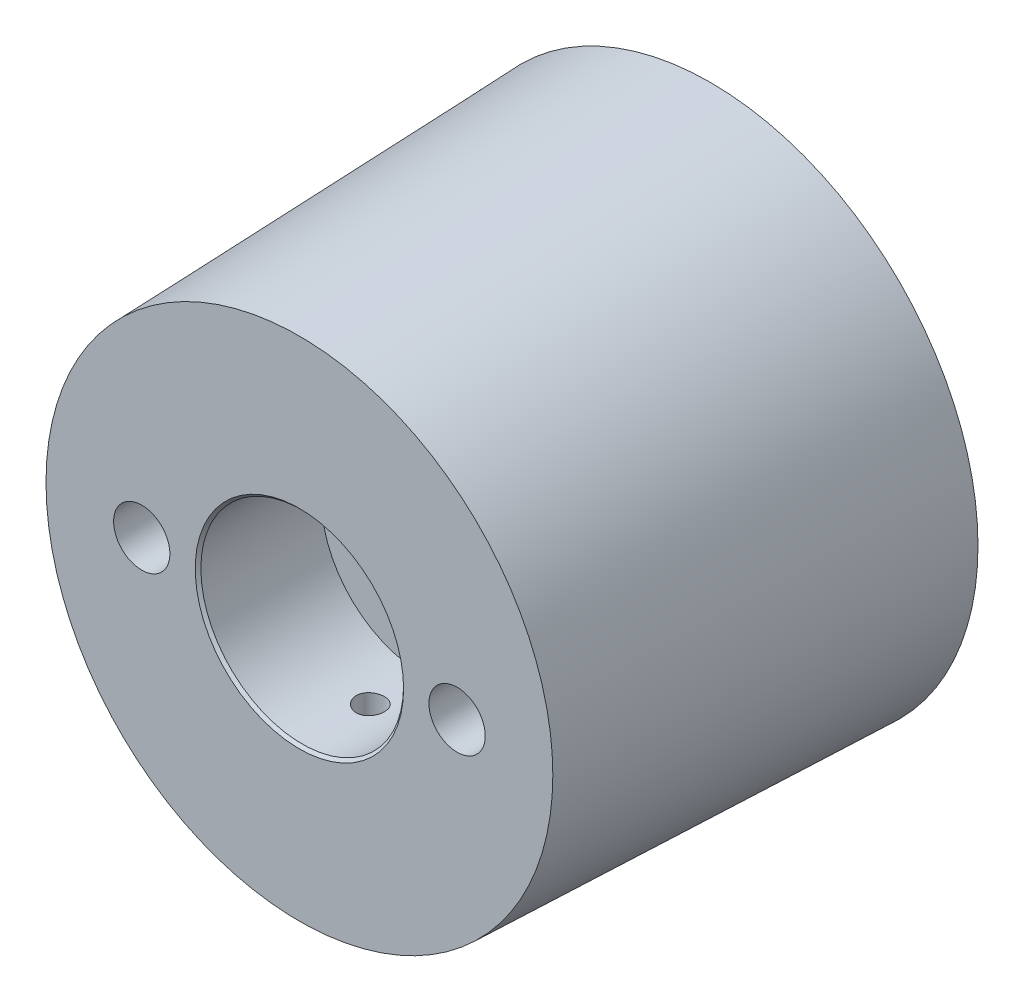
ISO-10303-21;
HEADER;
FILE_DESCRIPTION(('STEP AP214'),'2;1');
FILE_NAME('part.step','',(''),(''),'','','');
FILE_SCHEMA(('AUTOMOTIVE_DESIGN { 1 0 10303 214 1 1 1 1 }'));
ENDSEC;
DATA;
#1=APPLICATION_CONTEXT('core data for automotive mechanical design processes');
#2=APPLICATION_PROTOCOL_DEFINITION('international standard','automotive_design',2000,#1);
#3=PRODUCT_CONTEXT('',#1,'mechanical');
#4=PRODUCT('Part','Part','',(#3));
#5=PRODUCT_RELATED_PRODUCT_CATEGORY('part','',(#4));
#6=PRODUCT_DEFINITION_FORMATION('','',#4);
#7=PRODUCT_DEFINITION_CONTEXT('part definition',#1,'design');
#8=PRODUCT_DEFINITION('design','',#6,#7);
#9=PRODUCT_DEFINITION_SHAPE('','',#8);
#10=(LENGTH_UNIT() NAMED_UNIT(*) SI_UNIT(.MILLI.,.METRE.));
#11=(NAMED_UNIT(*) PLANE_ANGLE_UNIT() SI_UNIT($,.RADIAN.));
#12=(NAMED_UNIT(*) SI_UNIT($,.STERADIAN.) SOLID_ANGLE_UNIT());
#13=UNCERTAINTY_MEASURE_WITH_UNIT(LENGTH_MEASURE(1.E-05),#10,'distance_accuracy_value','');
#14=(GEOMETRIC_REPRESENTATION_CONTEXT(3) GLOBAL_UNCERTAINTY_ASSIGNED_CONTEXT((#13)) GLOBAL_UNIT_ASSIGNED_CONTEXT((#10,
#11,#12)) REPRESENTATION_CONTEXT('',''));
#15=CARTESIAN_POINT('',(0.,0.,0.));
#16=DIRECTION('',(0.,0.,1.));
#17=DIRECTION('',(1.,0.,0.));
#18=AXIS2_PLACEMENT_3D('',#15,#16,#17);
#19=CARTESIAN_POINT('',(0.,0.,-3.0011));
#20=DIRECTION('',(0.,0.,1.));
#21=DIRECTION('',(1.,0.,0.));
#22=AXIS2_PLACEMENT_3D('',#19,#20,#21);
#23=CYLINDRICAL_SURFACE('',#22,8.);
#24=CARTESIAN_POINT('',(0.,0.,48.1));
#25=DIRECTION('',(0.,0.,1.));
#26=DIRECTION('',(1.,0.,0.));
#27=AXIS2_PLACEMENT_3D('',#24,#25,#26);
#28=CIRCLE('',#27,8.);
#29=CARTESIAN_POINT('',(8.,0.,48.1));
#30=VERTEX_POINT('',#29);
#31=EDGE_CURVE('E202',#30,#30,#28,.T.);
#32=ORIENTED_EDGE('',*,*,#31,.T.);
#33=EDGE_LOOP('',(#32));
#34=FACE_BOUND('',#33,.T.);
#35=CARTESIAN_POINT('',(0.,0.,44.7));
#36=DIRECTION('',(0.,0.,-1.));
#37=DIRECTION('',(-1.,0.,0.));
#38=AXIS2_PLACEMENT_3D('',#35,#36,#37);
#39=CIRCLE('',#38,8.);
#40=CARTESIAN_POINT('',(-8.,0.,44.7));
#41=VERTEX_POINT('',#40);
#42=EDGE_CURVE('E40',#41,#41,#39,.F.);
#43=ORIENTED_EDGE('',*,*,#42,.F.);
#44=EDGE_LOOP('',(#43));
#45=FACE_BOUND('',#44,.T.);
#46=ADVANCED_FACE('F36',(#34,#45),#23,.F.);
#47=CARTESIAN_POINT('',(0.,0.,-3.));
#48=DIRECTION('',(0.,0.,1.));
#49=DIRECTION('',(1.,0.,0.));
#50=AXIS2_PLACEMENT_3D('',#47,#48,#49);
#51=PLANE('',#50);
#52=CARTESIAN_POINT('',(0.,0.,-3.));
#53=DIRECTION('',(0.,0.,1.));
#54=DIRECTION('',(1.,0.,0.));
#55=AXIS2_PLACEMENT_3D('',#52,#53,#54);
#56=CIRCLE('',#55,35.55);
#57=CARTESIAN_POINT('',(35.55,0.,-3.));
#58=VERTEX_POINT('',#57);
#59=EDGE_CURVE('E49',#58,#58,#56,.T.);
#60=ORIENTED_EDGE('',*,*,#59,.T.);
#61=EDGE_LOOP('',(#60));
#62=FACE_BOUND('',#61,.T.);
#63=CARTESIAN_POINT('',(0.,0.,-3.));
#64=DIRECTION('',(0.,0.,1.));
#65=DIRECTION('',(1.,0.,0.));
#66=AXIS2_PLACEMENT_3D('',#63,#64,#65);
#67=CIRCLE('',#66,47.5);
#68=CARTESIAN_POINT('',(47.5,0.,-3.));
#69=VERTEX_POINT('',#68);
#70=EDGE_CURVE('E85',#69,#69,#67,.T.);
#71=ORIENTED_EDGE('',*,*,#70,.F.);
#72=EDGE_LOOP('',(#71));
#73=FACE_BOUND('',#72,.T.);
#74=ADVANCED_FACE('F112',(#62,#73),#51,.F.);
#75=CARTESIAN_POINT('',(0.,0.,70.));
#76=DIRECTION('',(0.,0.,1.));
#77=DIRECTION('',(1.,0.,0.));
#78=AXIS2_PLACEMENT_3D('',#75,#76,#77);
#79=PLANE('',#78);
#80=CARTESIAN_POINT('',(-28.,0.,70.));
#81=DIRECTION('',(0.,0.,1.));
#82=DIRECTION('',(1.,0.,0.));
#83=AXIS2_PLACEMENT_3D('',#80,#81,#82);
#84=CIRCLE('',#83,4.99999999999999);
#85=CARTESIAN_POINT('',(-23.,0.,70.));
#86=VERTEX_POINT('',#85);
#87=EDGE_CURVE('E72',#86,#86,#84,.T.);
#88=ORIENTED_EDGE('',*,*,#87,.F.);
#89=EDGE_LOOP('',(#88));
#90=FACE_BOUND('',#89,.T.);
#91=CARTESIAN_POINT('',(28.,0.,70.));
#92=DIRECTION('',(0.,0.,1.));
#93=DIRECTION('',(1.,0.,0.));
#94=AXIS2_PLACEMENT_3D('',#91,#92,#93);
#95=CIRCLE('',#94,4.99999999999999);
#96=CARTESIAN_POINT('',(33.,0.,70.));
#97=VERTEX_POINT('',#96);
#98=EDGE_CURVE('E59',#97,#97,#95,.T.);
#99=ORIENTED_EDGE('',*,*,#98,.F.);
#100=EDGE_LOOP('',(#99));
#101=FACE_BOUND('',#100,.T.);
#102=CARTESIAN_POINT('',(0.,0.,70.));
#103=DIRECTION('',(0.,0.,1.));
#104=DIRECTION('',(1.,0.,0.));
#105=AXIS2_PLACEMENT_3D('',#102,#103,#104);
#106=CIRCLE('',#105,18.5);
#107=CARTESIAN_POINT('',(18.5,0.,70.));
#108=VERTEX_POINT('',#107);
#109=EDGE_CURVE('E11',#108,#108,#106,.F.);
#110=ORIENTED_EDGE('',*,*,#109,.T.);
#111=EDGE_LOOP('',(#110));
#112=FACE_BOUND('',#111,.T.);
#113=CARTESIAN_POINT('',(0.,0.,70.));
#114=DIRECTION('',(0.,0.,1.));
#115=DIRECTION('',(1.,0.,0.));
#116=AXIS2_PLACEMENT_3D('',#113,#114,#115);
#117=CIRCLE('',#116,45.);
#118=CARTESIAN_POINT('',(45.,0.,70.));
#119=VERTEX_POINT('',#118);
#120=EDGE_CURVE('E90',#119,#119,#117,.T.);
#121=ORIENTED_EDGE('',*,*,#120,.T.);
#122=EDGE_LOOP('',(#121));
#123=FACE_BOUND('',#122,.T.);
#124=ADVANCED_FACE('F108',(#90,#101,#112,#123),#79,.T.);
#125=CARTESIAN_POINT('',(0.,0.,70.));
#126=DIRECTION('',(0.,0.,-1.));
#127=DIRECTION('',(-1.,0.,0.));
#128=AXIS2_PLACEMENT_3D('',#125,#126,#127);
#129=CONICAL_SURFACE('',#128,45.,0.0342331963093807);
#130=CARTESIAN_POINT('',(-1.39398991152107,-45.4812200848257,55.3247184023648));
#131=CARTESIAN_POINT('',(-1.51072007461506,-45.4749552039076,55.4031346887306));
#132=CARTESIAN_POINT('',(-1.6208809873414,-45.468099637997,55.4914646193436));
#133=CARTESIAN_POINT('',(-1.82485843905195,-45.4537233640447,55.6854317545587));
#134=CARTESIAN_POINT('',(-1.91865502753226,-45.4462018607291,55.7910897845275));
#135=CARTESIAN_POINT('',(-2.08711352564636,-45.4310455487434,56.0166170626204));
#136=CARTESIAN_POINT('',(-2.16178519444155,-45.4234107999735,56.1364790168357));
#137=CARTESIAN_POINT('',(-2.28991160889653,-45.408540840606,56.387033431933));
#138=CARTESIAN_POINT('',(-2.3433717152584,-45.4013055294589,56.5177231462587));
#139=CARTESIAN_POINT('',(-2.42759373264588,-45.3876687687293,56.7863194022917));
#140=CARTESIAN_POINT('',(-2.45834726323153,-45.3812676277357,56.924228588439));
#141=CARTESIAN_POINT('',(-2.4962257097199,-45.3696280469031,57.2033082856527));
#142=CARTESIAN_POINT('',(-2.5033499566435,-45.3643896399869,57.3444788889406));
#143=CARTESIAN_POINT('',(-2.49375078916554,-45.3552705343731,57.6257686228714));
#144=CARTESIAN_POINT('',(-2.47707495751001,-45.3513871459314,57.765889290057));
#145=CARTESIAN_POINT('',(-2.42041740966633,-45.344998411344,58.0413686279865));
#146=CARTESIAN_POINT('',(-2.38043596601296,-45.3424930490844,58.1767273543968));
#147=CARTESIAN_POINT('',(-2.27838195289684,-45.3387555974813,58.4386006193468));
#148=CARTESIAN_POINT('',(-2.21634635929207,-45.337521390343,58.5651295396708));
#149=CARTESIAN_POINT('',(-2.07193053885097,-45.3360928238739,58.8059949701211));
#150=CARTESIAN_POINT('',(-1.98955032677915,-45.3358984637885,58.9203314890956));
#151=CARTESIAN_POINT('',(-1.80677027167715,-45.3362412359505,59.1335815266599));
#152=CARTESIAN_POINT('',(-1.70636810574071,-45.3367784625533,59.2324930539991));
#153=CARTESIAN_POINT('',(-1.49039721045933,-45.3382382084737,59.4120734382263));
#154=CARTESIAN_POINT('',(-1.37482840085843,-45.3391607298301,59.4927421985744));
#155=CARTESIAN_POINT('',(-1.13170233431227,-45.3410548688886,59.6336077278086));
#156=CARTESIAN_POINT('',(-1.0041357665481,-45.3420265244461,59.6937884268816));
#157=CARTESIAN_POINT('',(-0.740709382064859,-45.343734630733,59.7918828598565));
#158=CARTESIAN_POINT('',(-0.604849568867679,-45.3444710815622,59.8297966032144));
#159=CARTESIAN_POINT('',(-0.328674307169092,-45.3455161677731,59.8822837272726));
#160=CARTESIAN_POINT('',(-0.188358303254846,-45.3458247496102,59.8968541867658));
#161=CARTESIAN_POINT('',(0.0927284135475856,-45.3459369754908,59.902231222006));
#162=CARTESIAN_POINT('',(0.233499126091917,-45.3457406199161,59.8930378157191));
#163=CARTESIAN_POINT('',(0.511470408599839,-45.3448917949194,59.8511527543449));
#164=CARTESIAN_POINT('',(0.648671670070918,-45.3442394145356,59.8184656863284));
#165=CARTESIAN_POINT('',(0.91563981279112,-45.3426466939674,59.7305267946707));
#166=CARTESIAN_POINT('',(1.04540667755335,-45.3417063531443,59.6752749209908));
#167=CARTESIAN_POINT('',(1.293845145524,-45.3398033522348,59.5437635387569));
#168=CARTESIAN_POINT('',(1.41251498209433,-45.3388406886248,59.4675006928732));
#169=CARTESIAN_POINT('',(1.63536937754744,-45.3372224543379,59.2961341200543));
#170=CARTESIAN_POINT('',(1.73955393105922,-45.3365668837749,59.2010303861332));
#171=CARTESIAN_POINT('',(1.93047949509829,-45.3359121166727,58.9946808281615));
#172=CARTESIAN_POINT('',(2.01722054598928,-45.3359129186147,58.8834350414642));
#173=CARTESIAN_POINT('',(2.17079370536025,-45.3368928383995,58.6479632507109));
#174=CARTESIAN_POINT('',(2.23762594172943,-45.3378719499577,58.523737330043));
#175=CARTESIAN_POINT('',(2.34944287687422,-45.3410560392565,58.2659359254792));
#176=CARTESIAN_POINT('',(2.39444339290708,-45.3432601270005,58.1323672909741));
#177=CARTESIAN_POINT('',(2.46139923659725,-45.3490300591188,57.8596026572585));
#178=CARTESIAN_POINT('',(2.483354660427,-45.3525958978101,57.7204066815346));
#179=CARTESIAN_POINT('',(2.50361021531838,-45.361086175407,57.4403998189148));
#180=CARTESIAN_POINT('',(2.50191938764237,-45.3660100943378,57.2995895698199));
#181=CARTESIAN_POINT('',(2.47497572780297,-45.3770671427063,57.0202906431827));
#182=CARTESIAN_POINT('',(2.44972272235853,-45.3832002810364,56.8818019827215));
#183=CARTESIAN_POINT('',(2.37634047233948,-45.3963929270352,56.6108671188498));
#184=CARTESIAN_POINT('',(2.32817994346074,-45.4034536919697,56.4784294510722));
#185=CARTESIAN_POINT('',(2.21034561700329,-45.418082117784,56.2235272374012));
#186=CARTESIAN_POINT('',(2.14067144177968,-45.42564978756,56.101062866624));
#187=CARTESIAN_POINT('',(1.98160436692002,-45.4408111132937,55.8693007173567));
#188=CARTESIAN_POINT('',(1.89216938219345,-45.4484047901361,55.7600318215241));
#189=CARTESIAN_POINT('',(1.69618703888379,-45.4630621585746,55.5580580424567));
#190=CARTESIAN_POINT('',(1.58963959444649,-45.4701258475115,55.4653532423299));
#191=CARTESIAN_POINT('',(1.36242436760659,-45.4831953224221,55.2991395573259));
#192=CARTESIAN_POINT('',(1.24175542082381,-45.4892010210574,55.2256322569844));
#193=CARTESIAN_POINT('',(0.989725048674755,-45.4996873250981,55.0999409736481));
#194=CARTESIAN_POINT('',(0.858364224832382,-45.5041680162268,55.047755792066));
#195=CARTESIAN_POINT('',(0.589097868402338,-45.5112373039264,54.9663426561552));
#196=CARTESIAN_POINT('',(0.451213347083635,-45.5138315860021,54.9370456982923));
#197=CARTESIAN_POINT('',(0.172424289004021,-45.516941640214,54.9019991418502));
#198=CARTESIAN_POINT('',(0.0315190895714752,-45.5174569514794,54.8962547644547));
#199=CARTESIAN_POINT('',(-0.248881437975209,-45.5163682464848,54.9084721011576));
#200=CARTESIAN_POINT('',(-0.388379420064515,-45.5147695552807,54.9263742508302));
#201=CARTESIAN_POINT('',(-0.662259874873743,-45.5095908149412,54.9852561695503));
#202=CARTESIAN_POINT('',(-0.796648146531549,-45.5060130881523,55.0262088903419));
#203=CARTESIAN_POINT('',(-1.00857210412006,-45.4988026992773,55.1107645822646));
#204=CARTESIAN_POINT('',(-1.08880123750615,-45.4956766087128,55.1478237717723));
#205=CARTESIAN_POINT('',(-1.24487942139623,-45.4888512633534,55.230193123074));
#206=CARTESIAN_POINT('',(-1.32072847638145,-45.4851520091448,55.2755032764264));
#207=CARTESIAN_POINT('',(-1.39398991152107,-45.4812200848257,55.3247184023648));
#208=B_SPLINE_CURVE_WITH_KNOTS('',3,(#130,#131,#132,#133,#134,#135,#136,#137,#138,#139,#140,
#141,#142,#143,#144,#145,#146,#147,#148,#149,#150,#151,#152,#153,#154,#155,#156,#157,#158,#159,
#160,#161,#162,#163,#164,#165,#166,#167,#168,#169,#170,#171,#172,#173,#174,#175,#176,#177,#178,
#179,#180,#181,#182,#183,#184,#185,#186,#187,#188,#189,#190,#191,#192,#193,#194,#195,#196,#197,
#198,#199,#200,#201,#202,#203,#204,#205,#206,#207),.UNSPECIFIED.,.T.,.F.,(4,2,2,2,2,2,2,2,2,2,2,
2,2,2,2,2,2,2,2,2,2,2,2,2,2,2,2,2,2,2,2,2,2,2,2,2,2,2,4),(0.,0.421966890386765,
0.844444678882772,1.26670645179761,1.68886144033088,2.11117215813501,2.53349483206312,
2.95497435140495,3.37644894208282,3.79722019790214,4.21799114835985,4.63881637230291,
5.05964382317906,5.48080059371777,5.90195718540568,6.32316647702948,6.74437545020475,
7.16550220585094,7.58662989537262,8.00782451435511,8.42901928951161,8.85021309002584,
9.27140418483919,9.69228966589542,10.1131733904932,10.5338961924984,10.9546220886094,
11.3759242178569,11.797233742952,12.2194493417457,12.6416670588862,13.0639196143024,
13.4861484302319,13.9070993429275,14.3281435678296,14.7481292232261,15.1676230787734,
15.4324554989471,15.6972876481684),.UNSPECIFIED.);
#209=CARTESIAN_POINT('',(-1.39398991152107,-45.4812200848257,55.3247184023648));
#210=VERTEX_POINT('',#209);
#211=EDGE_CURVE('E201',#210,#210,#208,.T.);
#212=ORIENTED_EDGE('',*,*,#211,.T.);
#213=EDGE_LOOP('',(#212));
#214=FACE_BOUND('',#213,.T.);
#215=ORIENTED_EDGE('',*,*,#120,.F.);
#216=EDGE_LOOP('',(#215));
#217=FACE_BOUND('',#216,.T.);
#218=ORIENTED_EDGE('',*,*,#70,.T.);
#219=EDGE_LOOP('',(#218));
#220=FACE_BOUND('',#219,.T.);
#221=ADVANCED_FACE('F97',(#214,#217,#220),#129,.T.);
#222=CARTESIAN_POINT('',(0.,0.,40.7));
#223=DIRECTION('',(0.,0.,-1.));
#224=DIRECTION('',(-1.,0.,0.));
#225=AXIS2_PLACEMENT_3D('',#222,#223,#224);
#226=CYLINDRICAL_SURFACE('',#225,35.05);
#227=CARTESIAN_POINT('',(0.,0.,-2.5));
#228=DIRECTION('',(0.,0.,1.));
#229=DIRECTION('',(1.,0.,0.));
#230=AXIS2_PLACEMENT_3D('',#227,#228,#229);
#231=CIRCLE('',#230,35.05);
#232=CARTESIAN_POINT('',(35.05,0.,-2.5));
#233=VERTEX_POINT('',#232);
#234=EDGE_CURVE('E134',#233,#233,#231,.F.);
#235=ORIENTED_EDGE('',*,*,#234,.T.);
#236=EDGE_LOOP('',(#235));
#237=FACE_BOUND('',#236,.T.);
#238=CARTESIAN_POINT('',(0.,0.,40.7));
#239=DIRECTION('',(0.,0.,-1.));
#240=DIRECTION('',(-1.,0.,0.));
#241=AXIS2_PLACEMENT_3D('',#238,#239,#240);
#242=CIRCLE('',#241,35.05);
#243=CARTESIAN_POINT('',(-35.05,0.,40.7));
#244=VERTEX_POINT('',#243);
#245=EDGE_CURVE('E82',#244,#244,#242,.T.);
#246=ORIENTED_EDGE('',*,*,#245,.F.);
#247=EDGE_LOOP('',(#246));
#248=FACE_BOUND('',#247,.T.);
#249=ADVANCED_FACE('F107',(#237,#248),#226,.F.);
#250=CARTESIAN_POINT('',(0.,0.,40.7));
#251=DIRECTION('',(0.,0.,-1.));
#252=DIRECTION('',(-1.,0.,0.));
#253=AXIS2_PLACEMENT_3D('',#250,#251,#252);
#254=PLANE('',#253);
#255=CARTESIAN_POINT('',(0.,0.,40.7));
#256=DIRECTION('',(0.,0.,-1.));
#257=DIRECTION('',(-1.,0.,0.));
#258=AXIS2_PLACEMENT_3D('',#255,#256,#257);
#259=CIRCLE('',#258,14.);
#260=CARTESIAN_POINT('',(-14.,0.,40.7));
#261=VERTEX_POINT('',#260);
#262=EDGE_CURVE('E250',#261,#261,#259,.T.);
#263=ORIENTED_EDGE('',*,*,#262,.F.);
#264=EDGE_LOOP('',(#263));
#265=FACE_BOUND('',#264,.T.);
#266=CARTESIAN_POINT('',(-28.,0.,40.7));
#267=DIRECTION('',(0.,0.,-1.));
#268=DIRECTION('',(-1.,0.,0.));
#269=AXIS2_PLACEMENT_3D('',#266,#267,#268);
#270=CIRCLE('',#269,2.64999999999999);
#271=CARTESIAN_POINT('',(-30.65,0.,40.7));
#272=VERTEX_POINT('',#271);
#273=EDGE_CURVE('E57',#272,#272,#270,.T.);
#274=ORIENTED_EDGE('',*,*,#273,.F.);
#275=EDGE_LOOP('',(#274));
#276=FACE_BOUND('',#275,.T.);
#277=CARTESIAN_POINT('',(28.,0.,40.7));
#278=DIRECTION('',(0.,0.,-1.));
#279=DIRECTION('',(-1.,0.,0.));
#280=AXIS2_PLACEMENT_3D('',#277,#278,#279);
#281=CIRCLE('',#280,2.64999999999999);
#282=CARTESIAN_POINT('',(25.35,0.,40.7));
#283=VERTEX_POINT('',#282);
#284=EDGE_CURVE('E53',#283,#283,#281,.T.);
#285=ORIENTED_EDGE('',*,*,#284,.F.);
#286=EDGE_LOOP('',(#285));
#287=FACE_BOUND('',#286,.T.);
#288=ORIENTED_EDGE('',*,*,#245,.T.);
#289=EDGE_LOOP('',(#288));
#290=FACE_BOUND('',#289,.T.);
#291=ADVANCED_FACE('F164',(#265,#276,#287,#290),#254,.T.);
#292=CARTESIAN_POINT('',(0.,0.,48.1));
#293=DIRECTION('',(0.,0.,1.));
#294=DIRECTION('',(1.,0.,0.));
#295=AXIS2_PLACEMENT_3D('',#292,#293,#294);
#296=CYLINDRICAL_SURFACE('',#295,18.);
#297=CARTESIAN_POINT('',(0.,-18.,59.9));
#298=CARTESIAN_POINT('',(0.139704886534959,-17.9999978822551,59.8999941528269));
#299=CARTESIAN_POINT('',(0.27949375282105,-17.998356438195,59.8882500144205));
#300=CARTESIAN_POINT('',(0.555172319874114,-17.991966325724,59.8415910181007));
#301=CARTESIAN_POINT('',(0.691057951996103,-17.9872145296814,59.8066528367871));
#302=CARTESIAN_POINT('',(0.954899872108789,-17.9751383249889,59.7146629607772));
#303=CARTESIAN_POINT('',(1.08286177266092,-17.9678157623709,59.6576271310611));
#304=CARTESIAN_POINT('',(1.32737637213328,-17.9514096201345,59.5230979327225));
#305=CARTESIAN_POINT('',(1.44393082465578,-17.9423263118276,59.4456077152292));
#306=CARTESIAN_POINT('',(1.66312915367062,-17.9233422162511,59.2718122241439));
#307=CARTESIAN_POINT('',(1.76568503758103,-17.9134368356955,59.1753964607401));
#308=CARTESIAN_POINT('',(1.95321646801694,-17.8939614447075,58.9667243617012));
#309=CARTESIAN_POINT('',(2.03819105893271,-17.8843914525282,58.8544671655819));
#310=CARTESIAN_POINT('',(2.18848372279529,-17.8666256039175,58.6167162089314));
#311=CARTESIAN_POINT('',(2.25371787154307,-17.8584356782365,58.4911689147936));
#312=CARTESIAN_POINT('',(2.36214175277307,-17.8444191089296,58.2307675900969));
#313=CARTESIAN_POINT('',(2.40533251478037,-17.8385923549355,58.0959139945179));
#314=CARTESIAN_POINT('',(2.46817293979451,-17.8300065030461,57.8216482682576));
#315=CARTESIAN_POINT('',(2.48797235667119,-17.8272278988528,57.6822710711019));
#316=CARTESIAN_POINT('',(2.50393173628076,-17.8249935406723,57.4021468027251));
#317=CARTESIAN_POINT('',(2.50009286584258,-17.8255376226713,57.2613997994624));
#318=CARTESIAN_POINT('',(2.46900727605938,-17.8298693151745,56.983582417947));
#319=CARTESIAN_POINT('',(2.44192648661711,-17.8336339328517,56.846493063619));
#320=CARTESIAN_POINT('',(2.36538513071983,-17.8439466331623,56.5788233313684));
#321=CARTESIAN_POINT('',(2.31592401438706,-17.850494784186,56.4482431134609));
#322=CARTESIAN_POINT('',(2.19585076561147,-17.8656624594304,56.1967885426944));
#323=CARTESIAN_POINT('',(2.1251675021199,-17.8742889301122,56.0759485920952));
#324=CARTESIAN_POINT('',(1.96470715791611,-17.8926360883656,55.8477820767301));
#325=CARTESIAN_POINT('',(1.87492900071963,-17.9023568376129,55.7404562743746));
#326=CARTESIAN_POINT('',(1.67791243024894,-17.9218991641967,55.541402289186));
#327=CARTESIAN_POINT('',(1.57053118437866,-17.9317208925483,55.449815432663));
#328=CARTESIAN_POINT('',(1.34184571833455,-17.9502810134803,55.2859428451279));
#329=CARTESIAN_POINT('',(1.22054145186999,-17.9590194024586,55.2136571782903));
#330=CARTESIAN_POINT('',(0.967337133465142,-17.9744355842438,55.0904349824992));
#331=CARTESIAN_POINT('',(0.835432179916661,-17.9811124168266,55.0395083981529));
#332=CARTESIAN_POINT('',(0.564829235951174,-17.9916448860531,54.960567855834));
#333=CARTESIAN_POINT('',(0.426131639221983,-17.995500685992,54.9325525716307));
#334=CARTESIAN_POINT('',(0.147101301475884,-17.9999352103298,54.9004155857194));
#335=CARTESIAN_POINT('',(0.0067913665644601,-18.0005406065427,54.8960994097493));
#336=CARTESIAN_POINT('',(-0.272550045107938,-17.9984784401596,54.9109683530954));
#337=CARTESIAN_POINT('',(-0.411581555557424,-17.9958109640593,54.9301528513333));
#338=CARTESIAN_POINT('',(-0.683837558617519,-17.9875193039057,54.9913169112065));
#339=CARTESIAN_POINT('',(-0.817083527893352,-17.981907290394,55.0332026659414));
#340=CARTESIAN_POINT('',(-1.07466091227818,-17.9683542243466,55.1384819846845));
#341=CARTESIAN_POINT('',(-1.19899196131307,-17.9604130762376,55.2018764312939));
#342=CARTESIAN_POINT('',(-1.43607162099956,-17.9430190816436,55.3488364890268));
#343=CARTESIAN_POINT('',(-1.54874236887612,-17.9335570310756,55.432526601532));
#344=CARTESIAN_POINT('',(-1.75850834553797,-17.9142056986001,55.6175277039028));
#345=CARTESIAN_POINT('',(-1.85560280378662,-17.9043163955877,55.7188395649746));
#346=CARTESIAN_POINT('',(-2.03215948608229,-17.8851416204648,55.9370698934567));
#347=CARTESIAN_POINT('',(-2.11149200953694,-17.8758609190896,56.0540937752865));
#348=CARTESIAN_POINT('',(-2.24937391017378,-17.8590358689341,56.2999200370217));
#349=CARTESIAN_POINT('',(-2.30792378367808,-17.8514914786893,56.4287221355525));
#350=CARTESIAN_POINT('',(-2.40237314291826,-17.8390269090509,56.6940470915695));
#351=CARTESIAN_POINT('',(-2.43834314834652,-17.8340985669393,56.8305444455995));
#352=CARTESIAN_POINT('',(-2.48683747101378,-17.8274016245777,57.1077155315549));
#353=CARTESIAN_POINT('',(-2.49936315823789,-17.8256328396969,57.2483890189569));
#354=CARTESIAN_POINT('',(-2.50058416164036,-17.8254614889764,57.5286276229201));
#355=CARTESIAN_POINT('',(-2.48948331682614,-17.8270301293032,57.6681918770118));
#356=CARTESIAN_POINT('',(-2.44420077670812,-17.8332946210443,57.9434492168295));
#357=CARTESIAN_POINT('',(-2.41001909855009,-17.8379904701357,58.0791423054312));
#358=CARTESIAN_POINT('',(-2.31961344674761,-17.849970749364,58.3427627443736));
#359=CARTESIAN_POINT('',(-2.26340167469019,-17.8572537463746,58.470694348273));
#360=CARTESIAN_POINT('',(-2.13055155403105,-17.873589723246,58.715343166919));
#361=CARTESIAN_POINT('',(-2.05391271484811,-17.8826427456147,58.8320601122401));
#362=CARTESIAN_POINT('',(-1.88163580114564,-17.901592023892,59.0520052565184));
#363=CARTESIAN_POINT('',(-1.78584624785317,-17.911494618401,59.1551142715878));
#364=CARTESIAN_POINT('',(-1.57830619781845,-17.9309729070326,59.343869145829));
#365=CARTESIAN_POINT('',(-1.46655197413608,-17.940548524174,59.4295109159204));
#366=CARTESIAN_POINT('',(-1.22964388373,-17.9583446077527,59.581252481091));
#367=CARTESIAN_POINT('',(-1.104429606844,-17.9665585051,59.6472587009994));
#368=CARTESIAN_POINT('',(-0.844642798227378,-17.9806405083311,59.7572083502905));
#369=CARTESIAN_POINT('',(-0.710080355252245,-17.9865110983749,59.8011751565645));
#370=CARTESIAN_POINT('',(-0.479058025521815,-17.9938697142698,59.855565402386));
#371=CARTESIAN_POINT('',(-0.384039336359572,-17.9961570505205,59.8722036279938));
#372=CARTESIAN_POINT('',(-0.192693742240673,-17.9992229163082,59.8944228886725));
#373=CARTESIAN_POINT('',(-0.0963668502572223,-18.0000014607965,59.9000040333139));
#374=CARTESIAN_POINT('',(0.,-18.,59.9));
#375=B_SPLINE_CURVE_WITH_KNOTS('',3,(#297,#298,#299,#300,#301,#302,#303,#304,#305,#306,#307,
#308,#309,#310,#311,#312,#313,#314,#315,#316,#317,#318,#319,#320,#321,#322,#323,#324,#325,#326,
#327,#328,#329,#330,#331,#332,#333,#334,#335,#336,#337,#338,#339,#340,#341,#342,#343,#344,#345,
#346,#347,#348,#349,#350,#351,#352,#353,#354,#355,#356,#357,#358,#359,#360,#361,#362,#363,#364,
#365,#366,#367,#368,#369,#370,#371,#372,#373,#374),.UNSPECIFIED.,.T.,.F.,(4,2,2,2,2,2,2,2,2,2,2,
2,2,2,2,2,2,2,2,2,2,2,2,2,2,2,2,2,2,2,2,2,2,2,2,2,2,2,4),(0.,0.418762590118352,
0.837946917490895,1.25683084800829,1.67565028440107,2.09699175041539,2.51835611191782,
2.94148747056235,3.36459906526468,3.78498691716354,4.20535401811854,4.62274474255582,
5.04014572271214,5.45896164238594,5.87780117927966,6.3002246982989,6.72264962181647,
7.14527100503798,7.56786792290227,7.98699178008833,8.40610456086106,8.82349852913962,
9.24090962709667,9.66094910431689,10.0810093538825,10.504043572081,10.9270676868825,
11.3487639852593,11.7704356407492,12.1884840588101,12.6065321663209,13.024349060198,
13.4421759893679,13.863448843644,14.2848202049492,14.7081686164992,15.1310670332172,
15.4199275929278,15.7087852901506),.UNSPECIFIED.);
#376=CARTESIAN_POINT('',(0.,-18.,59.9));
#377=VERTEX_POINT('',#376);
#378=EDGE_CURVE('E195',#377,#377,#375,.T.);
#379=ORIENTED_EDGE('',*,*,#378,.F.);
#380=EDGE_LOOP('',(#379));
#381=FACE_BOUND('',#380,.T.);
#382=CARTESIAN_POINT('',(0.,0.,69.5));
#383=DIRECTION('',(0.,0.,1.));
#384=DIRECTION('',(1.,0.,0.));
#385=AXIS2_PLACEMENT_3D('',#382,#383,#384);
#386=CIRCLE('',#385,18.);
#387=CARTESIAN_POINT('',(18.,0.,69.5));
#388=VERTEX_POINT('',#387);
#389=EDGE_CURVE('E44',#388,#388,#386,.T.);
#390=ORIENTED_EDGE('',*,*,#389,.T.);
#391=EDGE_LOOP('',(#390));
#392=FACE_BOUND('',#391,.T.);
#393=CARTESIAN_POINT('',(0.,0.,48.1));
#394=DIRECTION('',(0.,0.,1.));
#395=DIRECTION('',(1.,0.,0.));
#396=AXIS2_PLACEMENT_3D('',#393,#394,#395);
#397=CIRCLE('',#396,18.);
#398=CARTESIAN_POINT('',(18.,0.,48.1));
#399=VERTEX_POINT('',#398);
#400=EDGE_CURVE('E55',#399,#399,#397,.T.);
#401=ORIENTED_EDGE('',*,*,#400,.F.);
#402=EDGE_LOOP('',(#401));
#403=FACE_BOUND('',#402,.T.);
#404=ADVANCED_FACE('F168',(#381,#392,#403),#296,.F.);
#405=CARTESIAN_POINT('',(0.,0.,48.1));
#406=DIRECTION('',(0.,0.,1.));
#407=DIRECTION('',(1.,0.,0.));
#408=AXIS2_PLACEMENT_3D('',#405,#406,#407);
#409=PLANE('',#408);
#410=ORIENTED_EDGE('',*,*,#31,.F.);
#411=EDGE_LOOP('',(#410));
#412=FACE_BOUND('',#411,.T.);
#413=ORIENTED_EDGE('',*,*,#400,.T.);
#414=EDGE_LOOP('',(#413));
#415=FACE_BOUND('',#414,.T.);
#416=ADVANCED_FACE('F159',(#412,#415),#409,.T.);
#417=CARTESIAN_POINT('',(0.,0.,-2.5));
#418=DIRECTION('',(0.,0.,-1.));
#419=DIRECTION('',(-1.,0.,0.));
#420=AXIS2_PLACEMENT_3D('',#417,#418,#419);
#421=CONICAL_SURFACE('',#420,35.05,0.785398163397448);
#422=ORIENTED_EDGE('',*,*,#59,.F.);
#423=EDGE_LOOP('',(#422));
#424=FACE_BOUND('',#423,.T.);
#425=ORIENTED_EDGE('',*,*,#234,.F.);
#426=EDGE_LOOP('',(#425));
#427=FACE_BOUND('',#426,.T.);
#428=ADVANCED_FACE('F156',(#424,#427),#421,.F.);
#429=CARTESIAN_POINT('',(0.,0.,69.5));
#430=DIRECTION('',(0.,0.,1.));
#431=DIRECTION('',(1.,0.,0.));
#432=AXIS2_PLACEMENT_3D('',#429,#430,#431);
#433=CONICAL_SURFACE('',#432,18.,0.785398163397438);
#434=ORIENTED_EDGE('',*,*,#109,.F.);
#435=EDGE_LOOP('',(#434));
#436=FACE_BOUND('',#435,.T.);
#437=ORIENTED_EDGE('',*,*,#389,.F.);
#438=EDGE_LOOP('',(#437));
#439=FACE_BOUND('',#438,.T.);
#440=ADVANCED_FACE('F38',(#436,#439),#433,.F.);
#441=CARTESIAN_POINT('',(28.,0.,70.));
#442=DIRECTION('',(0.,0.,1.));
#443=DIRECTION('',(1.,0.,0.));
#444=AXIS2_PLACEMENT_3D('',#441,#442,#443);
#445=CYLINDRICAL_SURFACE('',#444,2.64999999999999);
#446=ORIENTED_EDGE('',*,*,#284,.T.);
#447=EDGE_LOOP('',(#446));
#448=FACE_BOUND('',#447,.T.);
#449=CARTESIAN_POINT('',(28.,0.,57.));
#450=DIRECTION('',(0.,0.,1.));
#451=DIRECTION('',(1.,0.,0.));
#452=AXIS2_PLACEMENT_3D('',#449,#450,#451);
#453=CIRCLE('',#452,2.65);
#454=CARTESIAN_POINT('',(30.65,0.,57.));
#455=VERTEX_POINT('',#454);
#456=EDGE_CURVE('E56',#455,#455,#453,.T.);
#457=ORIENTED_EDGE('',*,*,#456,.T.);
#458=EDGE_LOOP('',(#457));
#459=FACE_BOUND('',#458,.T.);
#460=ADVANCED_FACE('F231',(#448,#459),#445,.F.);
#461=CARTESIAN_POINT('',(30.65,0.,57.));
#462=DIRECTION('',(0.,0.,-1.));
#463=DIRECTION('',(-1.,0.,0.));
#464=AXIS2_PLACEMENT_3D('',#461,#462,#463);
#465=PLANE('',#464);
#466=ORIENTED_EDGE('',*,*,#456,.F.);
#467=EDGE_LOOP('',(#466));
#468=FACE_BOUND('',#467,.T.);
#469=CARTESIAN_POINT('',(28.,0.,57.));
#470=DIRECTION('',(0.,0.,1.));
#471=DIRECTION('',(1.,0.,0.));
#472=AXIS2_PLACEMENT_3D('',#469,#470,#471);
#473=CIRCLE('',#472,5.);
#474=CARTESIAN_POINT('',(33.,0.,57.));
#475=VERTEX_POINT('',#474);
#476=EDGE_CURVE('E64',#475,#475,#473,.T.);
#477=ORIENTED_EDGE('',*,*,#476,.T.);
#478=EDGE_LOOP('',(#477));
#479=FACE_BOUND('',#478,.T.);
#480=ADVANCED_FACE('F227',(#468,#479),#465,.F.);
#481=CARTESIAN_POINT('',(28.,0.,70.));
#482=DIRECTION('',(0.,0.,1.));
#483=DIRECTION('',(1.,0.,0.));
#484=AXIS2_PLACEMENT_3D('',#481,#482,#483);
#485=CYLINDRICAL_SURFACE('',#484,5.);
#486=ORIENTED_EDGE('',*,*,#476,.F.);
#487=EDGE_LOOP('',(#486));
#488=FACE_BOUND('',#487,.T.);
#489=ORIENTED_EDGE('',*,*,#98,.T.);
#490=EDGE_LOOP('',(#489));
#491=FACE_BOUND('',#490,.T.);
#492=ADVANCED_FACE('F224',(#488,#491),#485,.F.);
#493=CARTESIAN_POINT('',(-28.,0.,70.));
#494=DIRECTION('',(0.,0.,1.));
#495=DIRECTION('',(1.,0.,0.));
#496=AXIS2_PLACEMENT_3D('',#493,#494,#495);
#497=CYLINDRICAL_SURFACE('',#496,2.64999999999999);
#498=ORIENTED_EDGE('',*,*,#273,.T.);
#499=EDGE_LOOP('',(#498));
#500=FACE_BOUND('',#499,.T.);
#501=CARTESIAN_POINT('',(-28.,0.,57.));
#502=DIRECTION('',(0.,0.,1.));
#503=DIRECTION('',(1.,0.,0.));
#504=AXIS2_PLACEMENT_3D('',#501,#502,#503);
#505=CIRCLE('',#504,2.65);
#506=CARTESIAN_POINT('',(-25.35,0.,57.));
#507=VERTEX_POINT('',#506);
#508=EDGE_CURVE('E60',#507,#507,#505,.T.);
#509=ORIENTED_EDGE('',*,*,#508,.T.);
#510=EDGE_LOOP('',(#509));
#511=FACE_BOUND('',#510,.T.);
#512=ADVANCED_FACE('F220',(#500,#511),#497,.F.);
#513=CARTESIAN_POINT('',(-25.35,0.,57.));
#514=DIRECTION('',(0.,0.,-1.));
#515=DIRECTION('',(-1.,0.,0.));
#516=AXIS2_PLACEMENT_3D('',#513,#514,#515);
#517=PLANE('',#516);
#518=ORIENTED_EDGE('',*,*,#508,.F.);
#519=EDGE_LOOP('',(#518));
#520=FACE_BOUND('',#519,.T.);
#521=CARTESIAN_POINT('',(-28.,0.,57.));
#522=DIRECTION('',(0.,0.,1.));
#523=DIRECTION('',(1.,0.,0.));
#524=AXIS2_PLACEMENT_3D('',#521,#522,#523);
#525=CIRCLE('',#524,5.);
#526=CARTESIAN_POINT('',(-23.,0.,57.));
#527=VERTEX_POINT('',#526);
#528=EDGE_CURVE('E67',#527,#527,#525,.T.);
#529=ORIENTED_EDGE('',*,*,#528,.T.);
#530=EDGE_LOOP('',(#529));
#531=FACE_BOUND('',#530,.T.);
#532=ADVANCED_FACE('F216',(#520,#531),#517,.F.);
#533=CARTESIAN_POINT('',(-28.,0.,70.));
#534=DIRECTION('',(0.,0.,1.));
#535=DIRECTION('',(1.,0.,0.));
#536=AXIS2_PLACEMENT_3D('',#533,#534,#535);
#537=CYLINDRICAL_SURFACE('',#536,5.);
#538=ORIENTED_EDGE('',*,*,#528,.F.);
#539=EDGE_LOOP('',(#538));
#540=FACE_BOUND('',#539,.T.);
#541=ORIENTED_EDGE('',*,*,#87,.T.);
#542=EDGE_LOOP('',(#541));
#543=FACE_BOUND('',#542,.T.);
#544=ADVANCED_FACE('F211',(#540,#543),#537,.F.);
#545=CARTESIAN_POINT('',(0.,-47.5011,57.4));
#546=DIRECTION('',(0.,1.,0.));
#547=DIRECTION('',(0.,0.,1.));
#548=AXIS2_PLACEMENT_3D('',#545,#546,#547);
#549=CYLINDRICAL_SURFACE('',#548,2.5);
#550=ORIENTED_EDGE('',*,*,#211,.F.);
#551=EDGE_LOOP('',(#550));
#552=FACE_BOUND('',#551,.T.);
#553=ORIENTED_EDGE('',*,*,#378,.T.);
#554=EDGE_LOOP('',(#553));
#555=FACE_BOUND('',#554,.T.);
#556=ADVANCED_FACE('F206',(#552,#555),#549,.F.);
#557=CARTESIAN_POINT('',(0.,0.,44.7));
#558=DIRECTION('',(0.,0.,-1.));
#559=DIRECTION('',(-1.,0.,0.));
#560=AXIS2_PLACEMENT_3D('',#557,#558,#559);
#561=PLANE('',#560);
#562=CARTESIAN_POINT('',(0.,0.,44.7));
#563=DIRECTION('',(0.,0.,-1.));
#564=DIRECTION('',(-1.,0.,0.));
#565=AXIS2_PLACEMENT_3D('',#562,#563,#564);
#566=CIRCLE('',#565,14.);
#567=CARTESIAN_POINT('',(-14.,0.,44.7));
#568=VERTEX_POINT('',#567);
#569=EDGE_CURVE('E246',#568,#568,#566,.T.);
#570=ORIENTED_EDGE('',*,*,#569,.T.);
#571=EDGE_LOOP('',(#570));
#572=FACE_BOUND('',#571,.T.);
#573=ORIENTED_EDGE('',*,*,#42,.T.);
#574=EDGE_LOOP('',(#573));
#575=FACE_BOUND('',#574,.T.);
#576=ADVANCED_FACE('F210',(#572,#575),#561,.T.);
#577=CARTESIAN_POINT('',(0.,0.,44.7));
#578=DIRECTION('',(0.,0.,-1.));
#579=DIRECTION('',(-1.,0.,0.));
#580=AXIS2_PLACEMENT_3D('',#577,#578,#579);
#581=CYLINDRICAL_SURFACE('',#580,14.);
#582=ORIENTED_EDGE('',*,*,#569,.F.);
#583=EDGE_LOOP('',(#582));
#584=FACE_BOUND('',#583,.T.);
#585=ORIENTED_EDGE('',*,*,#262,.T.);
#586=EDGE_LOOP('',(#585));
#587=FACE_BOUND('',#586,.T.);
#588=ADVANCED_FACE('F188',(#584,#587),#581,.F.);
#589=CLOSED_SHELL('',(#46,#74,#124,#221,#249,#291,#404,#416,#428,#440,#460,#480,#492,#512,#532,
#544,#556,#576,#588));
#590=MANIFOLD_SOLID_BREP('B2',#589);
#591=ADVANCED_BREP_SHAPE_REPRESENTATION('',(#18,#590),#14);
#592=SHAPE_DEFINITION_REPRESENTATION(#9,#591);
ENDSEC;
END-ISO-10303-21;
